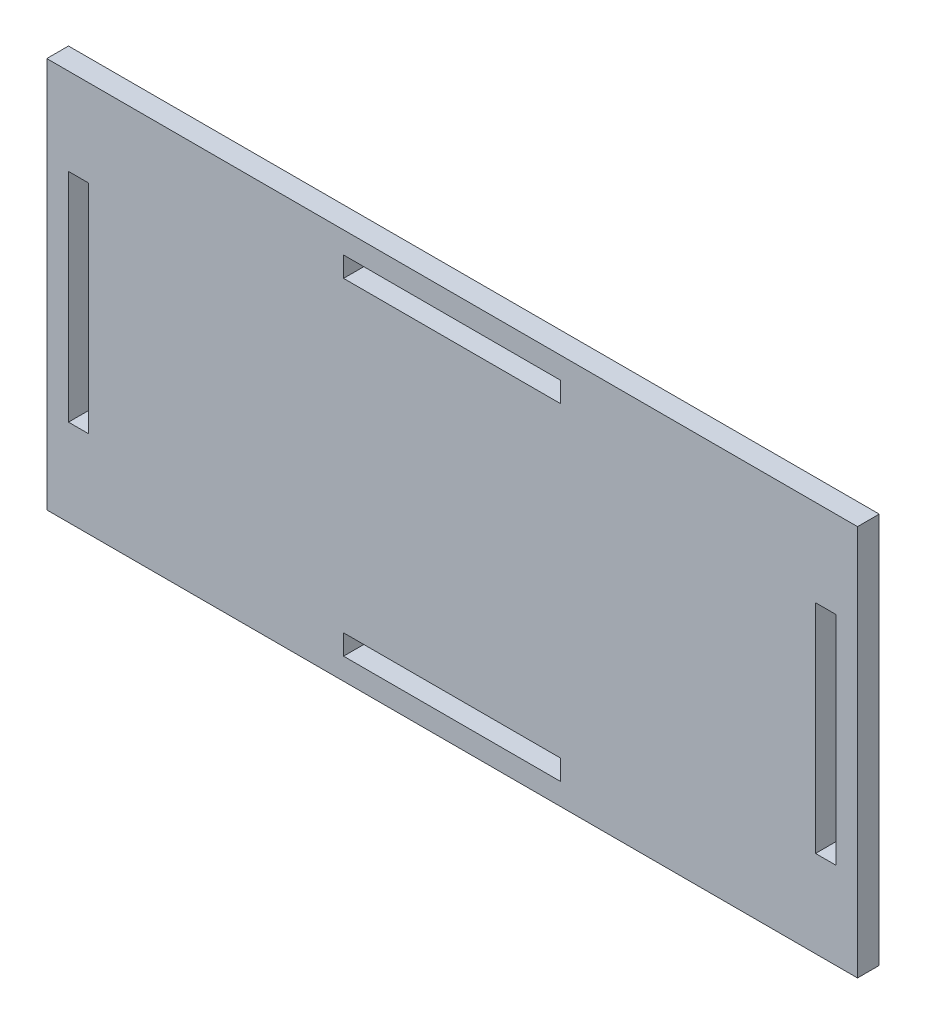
from build123d import *

# Parameters (mm, degrees)
CROQUIS1_W              = 112
CROQUIS1_H              = 54
CROQUIS1_W_2            = 30
CROQUIS1_H_2            = 2.8
CROQUIS1_W_3            = 2.8
CROQUIS1_H_3            = 30
SALIENTE_EXTRUIR1_DEPTH = 3


with BuildPart() as part:
    # Croquis1 → Saliente-Extruir1 (new body)
    with BuildSketch(Plane.XY):
        Rectangle(CROQUIS1_W, CROQUIS1_H)
        with Locations((0, 22.6)):
            Rectangle(CROQUIS1_W_2, CROQUIS1_H_2, mode=Mode.SUBTRACT)
        with Locations((-51.6, 0)):
            Rectangle(CROQUIS1_W_3, CROQUIS1_H_3, mode=Mode.SUBTRACT)
        with Locations((0, -22.6)):
            Rectangle(CROQUIS1_W_2, CROQUIS1_H_2, mode=Mode.SUBTRACT)
        with Locations((51.6, 0)):
            Rectangle(CROQUIS1_W_3, CROQUIS1_H_3, mode=Mode.SUBTRACT)
    extrude(amount=SALIENTE_EXTRUIR1_DEPTH)


solid = part.part
